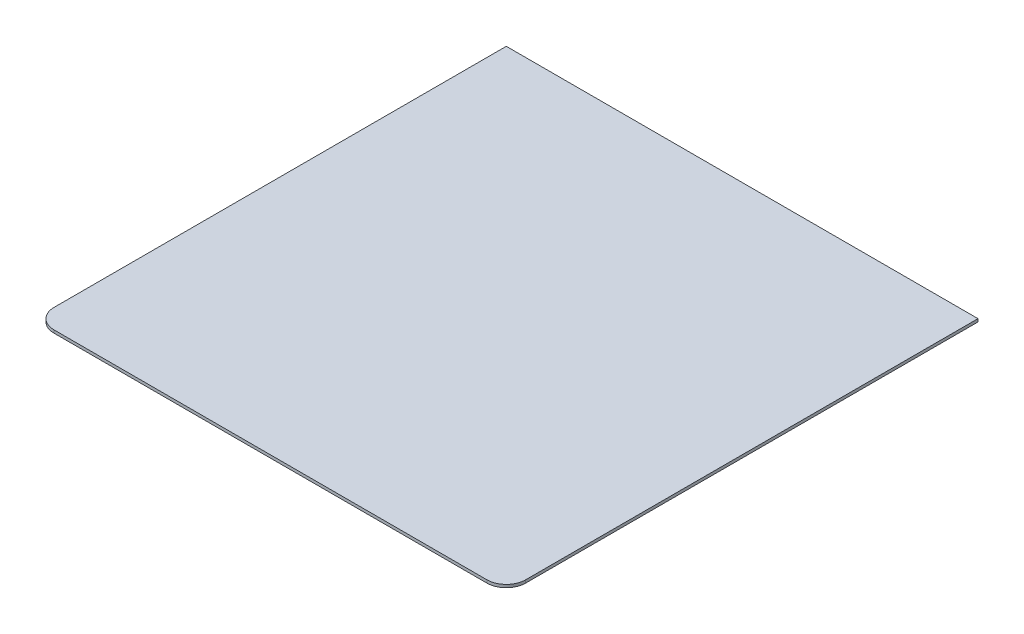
ISO-10303-21;
HEADER;
FILE_DESCRIPTION(('STEP AP214'),'2;1');
FILE_NAME('part.step','',(''),(''),'','','');
FILE_SCHEMA(('AUTOMOTIVE_DESIGN { 1 0 10303 214 1 1 1 1 }'));
ENDSEC;
DATA;
#1=APPLICATION_CONTEXT('core data for automotive mechanical design processes');
#2=APPLICATION_PROTOCOL_DEFINITION('international standard','automotive_design',2000,#1);
#3=PRODUCT_CONTEXT('',#1,'mechanical');
#4=PRODUCT('Part','Part','',(#3));
#5=PRODUCT_RELATED_PRODUCT_CATEGORY('part','',(#4));
#6=PRODUCT_DEFINITION_FORMATION('','',#4);
#7=PRODUCT_DEFINITION_CONTEXT('part definition',#1,'design');
#8=PRODUCT_DEFINITION('design','',#6,#7);
#9=PRODUCT_DEFINITION_SHAPE('','',#8);
#10=(LENGTH_UNIT() NAMED_UNIT(*) SI_UNIT(.MILLI.,.METRE.));
#11=(NAMED_UNIT(*) PLANE_ANGLE_UNIT() SI_UNIT($,.RADIAN.));
#12=(NAMED_UNIT(*) SI_UNIT($,.STERADIAN.) SOLID_ANGLE_UNIT());
#13=UNCERTAINTY_MEASURE_WITH_UNIT(LENGTH_MEASURE(1.E-05),#10,'distance_accuracy_value','');
#14=(GEOMETRIC_REPRESENTATION_CONTEXT(3) GLOBAL_UNCERTAINTY_ASSIGNED_CONTEXT((#13)) GLOBAL_UNIT_ASSIGNED_CONTEXT((#10,
#11,#12)) REPRESENTATION_CONTEXT('',''));
#15=CARTESIAN_POINT('',(0.,0.,0.));
#16=DIRECTION('',(0.,0.,1.));
#17=DIRECTION('',(1.,0.,0.));
#18=AXIS2_PLACEMENT_3D('',#15,#16,#17);
#19=CARTESIAN_POINT('',(490.,3.,-20.1794605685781));
#20=DIRECTION('',(-1.,0.,0.));
#21=DIRECTION('',(0.,0.,1.));
#22=AXIS2_PLACEMENT_3D('',#19,#20,#21);
#23=PLANE('',#22);
#24=DIRECTION('',(0.,0.,-1.));
#25=VECTOR('',#24,1.);
#26=CARTESIAN_POINT('',(490.,0.,-20.1794605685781));
#27=LINE('',#26,#25);
#28=CARTESIAN_POINT('',(490.,0.,-20.1794605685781));
#29=VERTEX_POINT('',#28);
#30=CARTESIAN_POINT('',(490.,0.,-490.));
#31=VERTEX_POINT('',#30);
#32=EDGE_CURVE('E126',#29,#31,#27,.T.);
#33=ORIENTED_EDGE('',*,*,#32,.T.);
#34=DIRECTION('',(0.,-1.,0.));
#35=VECTOR('',#34,1.);
#36=CARTESIAN_POINT('',(490.,3.,-490.));
#37=LINE('',#36,#35);
#38=CARTESIAN_POINT('',(490.,3.,-490.));
#39=VERTEX_POINT('',#38);
#40=EDGE_CURVE('E11',#39,#31,#37,.T.);
#41=ORIENTED_EDGE('',*,*,#40,.F.);
#42=DIRECTION('',(0.,0.,-1.));
#43=VECTOR('',#42,1.);
#44=CARTESIAN_POINT('',(490.,3.,-20.1794605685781));
#45=LINE('',#44,#43);
#46=CARTESIAN_POINT('',(490.,3.,-20.1794605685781));
#47=VERTEX_POINT('',#46);
#48=EDGE_CURVE('E136',#47,#39,#45,.T.);
#49=ORIENTED_EDGE('',*,*,#48,.F.);
#50=DIRECTION('',(0.,-1.,0.));
#51=VECTOR('',#50,1.);
#52=CARTESIAN_POINT('',(490.,3.,-20.1794605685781));
#53=LINE('',#52,#51);
#54=EDGE_CURVE('E122',#47,#29,#53,.T.);
#55=ORIENTED_EDGE('',*,*,#54,.T.);
#56=EDGE_LOOP('',(#33,#41,#49,#55));
#57=FACE_BOUND('',#56,.T.);
#58=ADVANCED_FACE('F42',(#57),#23,.F.);
#59=CARTESIAN_POINT('',(0.,3.,-490.));
#60=DIRECTION('',(0.,0.,1.));
#61=DIRECTION('',(1.,0.,0.));
#62=AXIS2_PLACEMENT_3D('',#59,#60,#61);
#63=PLANE('',#62);
#64=DIRECTION('',(-1.,0.,0.));
#65=VECTOR('',#64,1.);
#66=CARTESIAN_POINT('',(0.,0.,-490.));
#67=LINE('',#66,#65);
#68=CARTESIAN_POINT('',(0.,0.,-490.));
#69=VERTEX_POINT('',#68);
#70=EDGE_CURVE('E129',#31,#69,#67,.T.);
#71=ORIENTED_EDGE('',*,*,#70,.T.);
#72=DIRECTION('',(0.,-1.,0.));
#73=VECTOR('',#72,1.);
#74=CARTESIAN_POINT('',(0.,3.,-490.));
#75=LINE('',#74,#73);
#76=CARTESIAN_POINT('',(0.,3.,-490.));
#77=VERTEX_POINT('',#76);
#78=EDGE_CURVE('E50',#77,#69,#75,.T.);
#79=ORIENTED_EDGE('',*,*,#78,.F.);
#80=DIRECTION('',(-1.,0.,0.));
#81=VECTOR('',#80,1.);
#82=CARTESIAN_POINT('',(0.,3.,-490.));
#83=LINE('',#82,#81);
#84=EDGE_CURVE('E95',#39,#77,#83,.T.);
#85=ORIENTED_EDGE('',*,*,#84,.F.);
#86=ORIENTED_EDGE('',*,*,#40,.T.);
#87=EDGE_LOOP('',(#71,#79,#85,#86));
#88=FACE_BOUND('',#87,.T.);
#89=ADVANCED_FACE('F160',(#88),#63,.F.);
#90=CARTESIAN_POINT('',(0.,3.,-20.1794605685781));
#91=DIRECTION('',(1.,0.,0.));
#92=DIRECTION('',(0.,0.,-1.));
#93=AXIS2_PLACEMENT_3D('',#90,#91,#92);
#94=PLANE('',#93);
#95=DIRECTION('',(0.,0.,1.));
#96=VECTOR('',#95,1.);
#97=CARTESIAN_POINT('',(0.,0.,-20.1794605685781));
#98=LINE('',#97,#96);
#99=CARTESIAN_POINT('',(0.,0.,-20.1794605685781));
#100=VERTEX_POINT('',#99);
#101=EDGE_CURVE('E131',#69,#100,#98,.T.);
#102=ORIENTED_EDGE('',*,*,#101,.T.);
#103=DIRECTION('',(0.,-1.,0.));
#104=VECTOR('',#103,1.);
#105=CARTESIAN_POINT('',(0.,3.,-20.1794605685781));
#106=LINE('',#105,#104);
#107=CARTESIAN_POINT('',(0.,3.,-20.1794605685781));
#108=VERTEX_POINT('',#107);
#109=EDGE_CURVE('E117',#108,#100,#106,.T.);
#110=ORIENTED_EDGE('',*,*,#109,.F.);
#111=DIRECTION('',(0.,0.,1.));
#112=VECTOR('',#111,1.);
#113=CARTESIAN_POINT('',(0.,3.,-20.1794605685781));
#114=LINE('',#113,#112);
#115=EDGE_CURVE('E108',#77,#108,#114,.T.);
#116=ORIENTED_EDGE('',*,*,#115,.F.);
#117=ORIENTED_EDGE('',*,*,#78,.T.);
#118=EDGE_LOOP('',(#102,#110,#116,#117));
#119=FACE_BOUND('',#118,.T.);
#120=ADVANCED_FACE('F142',(#119),#94,.F.);
#121=CARTESIAN_POINT('',(20.1794605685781,3.,-20.1794605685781));
#122=DIRECTION('',(0.,-1.,0.));
#123=DIRECTION('',(0.,0.,-1.));
#124=AXIS2_PLACEMENT_3D('',#121,#122,#123);
#125=CYLINDRICAL_SURFACE('',#124,20.1794605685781);
#126=CARTESIAN_POINT('',(20.1794605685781,0.,-20.1794605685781));
#127=DIRECTION('',(0.,1.,0.));
#128=DIRECTION('',(0.,0.,-1.));
#129=AXIS2_PLACEMENT_3D('',#126,#127,#128);
#130=CIRCLE('',#129,20.1794605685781);
#131=CARTESIAN_POINT('',(20.1794605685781,0.,0.));
#132=VERTEX_POINT('',#131);
#133=EDGE_CURVE('E116',#100,#132,#130,.T.);
#134=ORIENTED_EDGE('',*,*,#133,.T.);
#135=DIRECTION('',(0.,-1.,0.));
#136=VECTOR('',#135,1.);
#137=CARTESIAN_POINT('',(20.1794605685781,3.,0.));
#138=LINE('',#137,#136);
#139=CARTESIAN_POINT('',(20.1794605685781,3.,0.));
#140=VERTEX_POINT('',#139);
#141=EDGE_CURVE('E113',#140,#132,#138,.T.);
#142=ORIENTED_EDGE('',*,*,#141,.F.);
#143=CARTESIAN_POINT('',(20.1794605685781,3.,-20.1794605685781));
#144=DIRECTION('',(0.,1.,0.));
#145=DIRECTION('',(0.,0.,-1.));
#146=AXIS2_PLACEMENT_3D('',#143,#144,#145);
#147=CIRCLE('',#146,20.1794605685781);
#148=EDGE_CURVE('E102',#108,#140,#147,.T.);
#149=ORIENTED_EDGE('',*,*,#148,.F.);
#150=ORIENTED_EDGE('',*,*,#109,.T.);
#151=EDGE_LOOP('',(#134,#142,#149,#150));
#152=FACE_BOUND('',#151,.T.);
#153=ADVANCED_FACE('F114',(#152),#125,.T.);
#154=CARTESIAN_POINT('',(20.1794605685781,3.,0.));
#155=DIRECTION('',(0.,0.,-1.));
#156=DIRECTION('',(-1.,0.,0.));
#157=AXIS2_PLACEMENT_3D('',#154,#155,#156);
#158=PLANE('',#157);
#159=DIRECTION('',(1.,0.,0.));
#160=VECTOR('',#159,1.);
#161=CARTESIAN_POINT('',(20.1794605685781,0.,0.));
#162=LINE('',#161,#160);
#163=CARTESIAN_POINT('',(469.820539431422,0.,0.));
#164=VERTEX_POINT('',#163);
#165=EDGE_CURVE('E81',#132,#164,#162,.T.);
#166=ORIENTED_EDGE('',*,*,#165,.T.);
#167=DIRECTION('',(0.,-1.,0.));
#168=VECTOR('',#167,1.);
#169=CARTESIAN_POINT('',(469.820539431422,3.,0.));
#170=LINE('',#169,#168);
#171=CARTESIAN_POINT('',(469.820539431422,3.,0.));
#172=VERTEX_POINT('',#171);
#173=EDGE_CURVE('E118',#172,#164,#170,.T.);
#174=ORIENTED_EDGE('',*,*,#173,.F.);
#175=DIRECTION('',(1.,0.,0.));
#176=VECTOR('',#175,1.);
#177=CARTESIAN_POINT('',(20.1794605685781,3.,0.));
#178=LINE('',#177,#176);
#179=EDGE_CURVE('E106',#140,#172,#178,.T.);
#180=ORIENTED_EDGE('',*,*,#179,.F.);
#181=ORIENTED_EDGE('',*,*,#141,.T.);
#182=EDGE_LOOP('',(#166,#174,#180,#181));
#183=FACE_BOUND('',#182,.T.);
#184=ADVANCED_FACE('F120',(#183),#158,.F.);
#185=CARTESIAN_POINT('',(469.820539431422,3.,-20.1794605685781));
#186=DIRECTION('',(0.,-1.,0.));
#187=DIRECTION('',(0.,0.,-1.));
#188=AXIS2_PLACEMENT_3D('',#185,#186,#187);
#189=CYLINDRICAL_SURFACE('',#188,20.1794605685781);
#190=CARTESIAN_POINT('',(469.820539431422,0.,-20.1794605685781));
#191=DIRECTION('',(0.,1.,0.));
#192=DIRECTION('',(0.,0.,-1.));
#193=AXIS2_PLACEMENT_3D('',#190,#191,#192);
#194=CIRCLE('',#193,20.1794605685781);
#195=EDGE_CURVE('E87',#164,#29,#194,.T.);
#196=ORIENTED_EDGE('',*,*,#195,.T.);
#197=ORIENTED_EDGE('',*,*,#54,.F.);
#198=CARTESIAN_POINT('',(469.820539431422,3.,-20.1794605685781));
#199=DIRECTION('',(0.,1.,0.));
#200=DIRECTION('',(0.,0.,-1.));
#201=AXIS2_PLACEMENT_3D('',#198,#199,#200);
#202=CIRCLE('',#201,20.1794605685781);
#203=EDGE_CURVE('E58',#172,#47,#202,.T.);
#204=ORIENTED_EDGE('',*,*,#203,.F.);
#205=ORIENTED_EDGE('',*,*,#173,.T.);
#206=EDGE_LOOP('',(#196,#197,#204,#205));
#207=FACE_BOUND('',#206,.T.);
#208=ADVANCED_FACE('F149',(#207),#189,.T.);
#209=CARTESIAN_POINT('',(20.1794605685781,3.,-20.1794605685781));
#210=DIRECTION('',(0.,-1.,0.));
#211=DIRECTION('',(0.,0.,-1.));
#212=AXIS2_PLACEMENT_3D('',#209,#210,#211);
#213=PLANE('',#212);
#214=ORIENTED_EDGE('',*,*,#48,.T.);
#215=ORIENTED_EDGE('',*,*,#84,.T.);
#216=ORIENTED_EDGE('',*,*,#115,.T.);
#217=ORIENTED_EDGE('',*,*,#148,.T.);
#218=ORIENTED_EDGE('',*,*,#179,.T.);
#219=ORIENTED_EDGE('',*,*,#203,.T.);
#220=EDGE_LOOP('',(#214,#215,#216,#217,#218,#219));
#221=FACE_BOUND('',#220,.T.);
#222=ADVANCED_FACE('F104',(#221),#213,.F.);
#223=CARTESIAN_POINT('',(20.1794605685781,0.,-20.1794605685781));
#224=DIRECTION('',(0.,-1.,0.));
#225=DIRECTION('',(0.,0.,-1.));
#226=AXIS2_PLACEMENT_3D('',#223,#224,#225);
#227=PLANE('',#226);
#228=ORIENTED_EDGE('',*,*,#32,.F.);
#229=ORIENTED_EDGE('',*,*,#195,.F.);
#230=ORIENTED_EDGE('',*,*,#165,.F.);
#231=ORIENTED_EDGE('',*,*,#133,.F.);
#232=ORIENTED_EDGE('',*,*,#101,.F.);
#233=ORIENTED_EDGE('',*,*,#70,.F.);
#234=EDGE_LOOP('',(#228,#229,#230,#231,#232,#233));
#235=FACE_BOUND('',#234,.T.);
#236=ADVANCED_FACE('F145',(#235),#227,.T.);
#237=CLOSED_SHELL('',(#58,#89,#120,#153,#184,#208,#222,#236));
#238=MANIFOLD_SOLID_BREP('B2',#237);
#239=ADVANCED_BREP_SHAPE_REPRESENTATION('',(#18,#238),#14);
#240=SHAPE_DEFINITION_REPRESENTATION(#9,#239);
ENDSEC;
END-ISO-10303-21;
